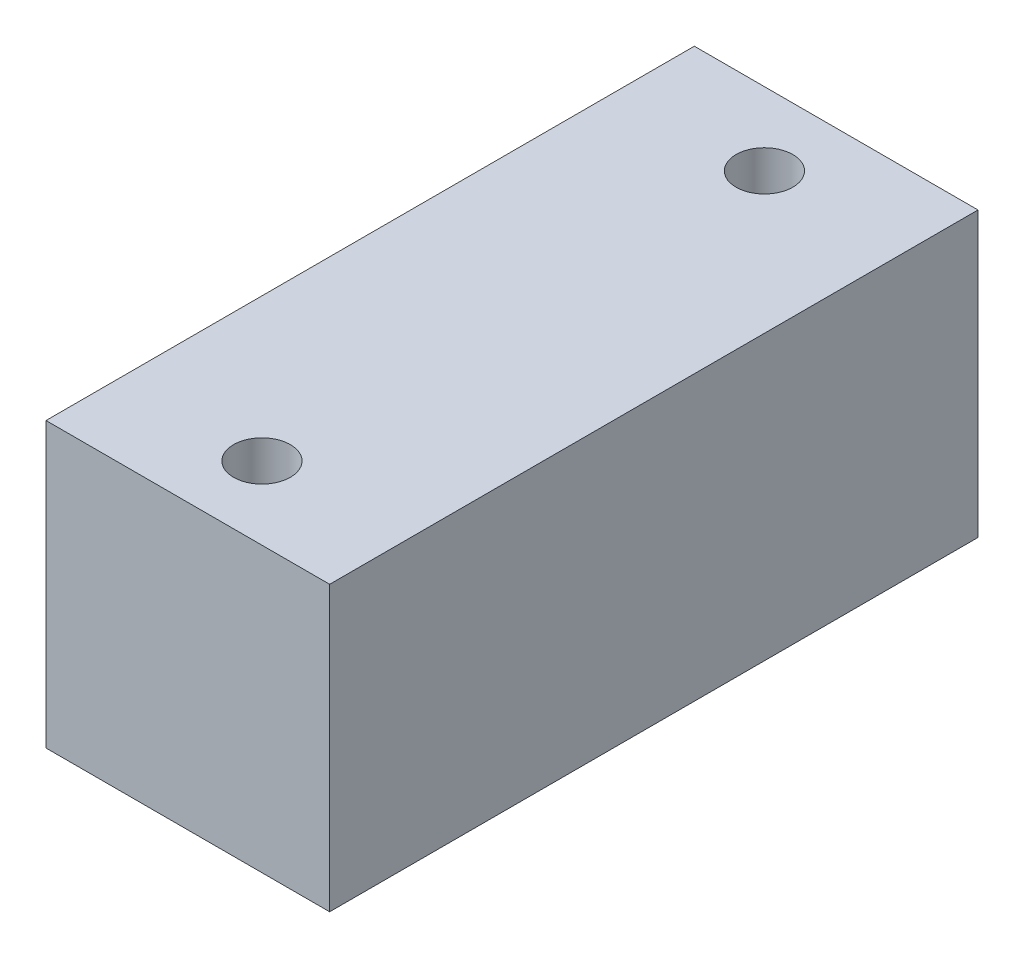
from build123d import *

# Parameters (mm, degrees)
ESQUISSE1_W             = 35
ESQUISSE1_H             = 35
BASE_EXTRUSION_DEPTH    = 80
ESQUISSE2_R             = 3.5
ENL_V_MAT_EXTRU_1_DEPTH = 95.074438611


with BuildPart() as part:
    # Esquisse1 → Base-Extrusion (new body)
    with BuildSketch(Plane.XY):
        with Locations((17.5, 17.5)):
            Rectangle(ESQUISSE1_W, ESQUISSE1_H)
    extrude(amount=BASE_EXTRUSION_DEPTH)

    # Esquisse2 → Enl_v. mat.-Extru.1 (cut, through all)
    with BuildSketch(Plane(origin=(0, 35, 0), x_dir=(-1, 0, 0), z_dir=(0, 1, 0))):
        with Locations(Location((-17.64548537, 9, 0), (0, 0, 90))):
            Circle(ESQUISSE2_R)
        with Locations(Location((-17.64548537, 71, 0), (0, 0, 90))):
            Circle(ESQUISSE2_R)
    extrude(amount=-ENL_V_MAT_EXTRU_1_DEPTH, mode=Mode.SUBTRACT)


solid = part.part
